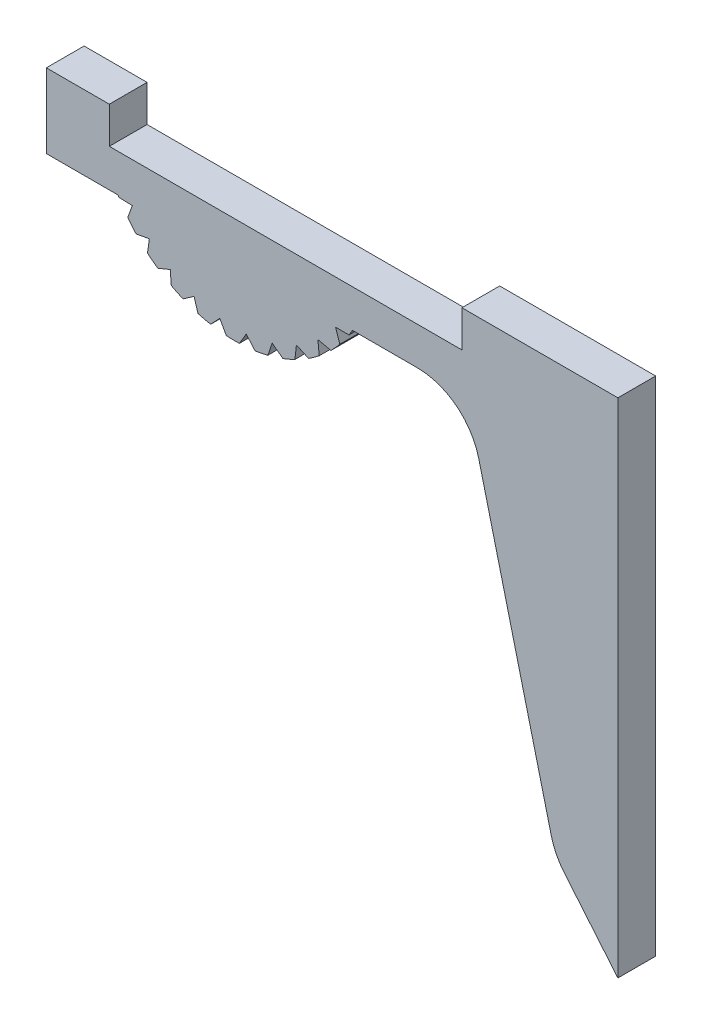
from build123d import *

# Parameters (mm, degrees)
BOSS_EXTRU_1_DEPTH      = 3
ESQUISSE2_W             = 28
ESQUISSE2_H             = 3
ENL_V_MAT_EXTRU_1_DEPTH = 3
ESQUISSE3_W             = 45.384651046
ESQUISSE3_H             = 0.1
ENL_V_MAT_EXTRU_2_DEPTH = 10
CONG_1_R                = 5
CONG_2_R                = 5
BOSS_EXTRU_2_DEPTH      = 3


with BuildPart() as part:
    # Esquisse1 → Boss.-Extru.1 (new body)
    with BuildSketch(Plane.XY):
        Polygon((0, -40), (0, 0), (-45.384651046, 0), (-45.384651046, -6), (-12, -6), (-5, -34), align=None)
    extrude(amount=-BOSS_EXTRU_1_DEPTH)

    # Esquisse2 → Enl_v. mat.-Extru.1 (cut)
    with BuildSketch(Plane(origin=(0, 0, -3), x_dir=(-1, 0, 0), z_dir=(0, 0, -1))):
        with Locations((26.384651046, -1.5)):
            Rectangle(ESQUISSE2_W, ESQUISSE2_H)
    extrude(amount=-ENL_V_MAT_EXTRU_1_DEPTH, mode=Mode.SUBTRACT)

    # Esquisse3 → Enl_v. mat.-Extru.2 (cut)
    with BuildSketch(Plane.XY):
        with Locations((-22.692325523, -0.05)):
            Rectangle(ESQUISSE3_W, ESQUISSE3_H)
    extrude(amount=-ENL_V_MAT_EXTRU_2_DEPTH, mode=Mode.SUBTRACT)

    # Cong_1
    cong_1_edges = [part.edges().sort_by_distance(p)[0] for p in [
        (-12, -6, -1.5),
    ]]
    fillet(cong_1_edges, radius=CONG_1_R)

    # Cong_2
    cong_2_edges = [part.edges().sort_by_distance(p)[0] for p in [
        (-5, -34, -1.5),
    ]]
    fillet(cong_2_edges, radius=CONG_2_R)

    # Esquisse4 → Boss.-Extru.2 (add)
    with BuildSketch(Plane(origin=(0, 0, -3), x_dir=(-1, 0, 0), z_dir=(0, 0, -1))):
        with BuildLine():
            Line((21.074206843, -6), (39.69509525, -6))
            ThreePointArc((39.69509525, -6), (39.658346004, -6.063533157), (39.621163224, -6.126813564))
            Line((39.621163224, -6.126813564), (38.557827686, -6.164845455))
            Line((38.557827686, -6.164845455), (38.921742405, -7.164692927))
            ThreePointArc((38.921742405, -7.164692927), (38.597373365, -7.56953787), (38.253824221, -7.958239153))
            Line((38.253824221, -7.958239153), (37.206538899, -7.770296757))
            Line((37.206538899, -7.770296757), (37.350533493, -8.8245237))
            ThreePointArc((37.350533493, -8.8245237), (36.947809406, -9.151522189), (36.529757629, -9.458682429))
            Line((36.529757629, -9.458682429), (35.545998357, -9.053285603))
            Line((35.545998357, -9.053285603), (35.463545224, -10.114101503))
            ThreePointArc((35.463545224, -10.114101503), (35.000722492, -10.348429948), (34.527119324, -10.560124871))
            Line((34.527119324, -10.560124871), (33.651482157, -9.95565118))
            Line((33.651482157, -9.95565118), (33.346319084, -10.974966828))
            ThreePointArc((33.346319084, -10.974966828), (32.844378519, -11.106002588), (32.336693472, -11.212635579))
            Line((32.336693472, -11.212635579), (31.608873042, -10.436487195))
            Line((31.608873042, -10.436487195), (31.094833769, -11.368094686))
            ThreePointArc((31.094833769, -11.368094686), (30.576529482, -11.389897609), (30.057777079, -11.386634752))
            Line((30.057777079, -11.386634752), (29.510767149, -10.473996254))
            Line((29.510767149, -10.473996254), (28.81115425, -11.275663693))
            ThreePointArc((28.81115425, -11.275663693), (28.299982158, -11.187245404), (27.79367863, -11.07423461))
            Line((27.79367863, -11.07423461), (27.452276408, -10.066477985))
            Line((27.452276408, -10.066477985), (26.598804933, -10.701863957))
            ThreePointArc((26.598804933, -10.701863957), (26.117937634, -10.507232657), (25.647034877, -10.289596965))
            Line((25.647034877, -10.289596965), (25.526716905, -9.232406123))
            Line((25.526716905, -9.232406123), (24.558076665, -9.67270713))
            ThreePointArc((24.558076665, -9.67270713), (24.129312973, -9.380685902), (23.715158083, -9.068291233))
            Line((23.715158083, -9.068291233), (23.821378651, -8.009591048))
            Line((23.821378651, -8.009591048), (22.78148032, -8.23484724))
            ThreePointArc((22.78148032, -8.23484724), (22.424257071, -7.858674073), (22.085624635, -7.465681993))
            Line((22.085624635, -7.465681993), (22.413568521, -6.453465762))
            Line((22.413568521, -6.453465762), (21.349553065, -6.453465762))
            ThreePointArc((21.349553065, -6.453465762), (21.209078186, -6.228434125), (21.074206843, -6))
        make_face()
    extrude(amount=-BOSS_EXTRU_2_DEPTH)


solid = part.part
